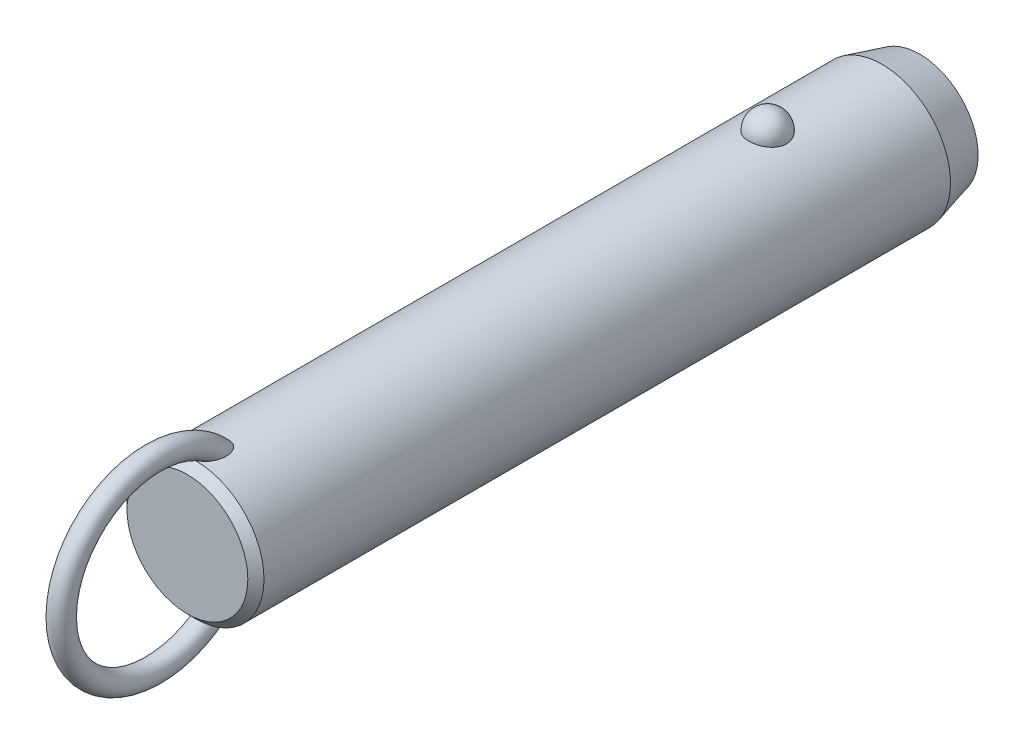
ISO-10303-21;
HEADER;
FILE_DESCRIPTION(('STEP AP214'),'2;1');
FILE_NAME('part.step','',(''),(''),'','','');
FILE_SCHEMA(('AUTOMOTIVE_DESIGN { 1 0 10303 214 1 1 1 1 }'));
ENDSEC;
DATA;
#1=APPLICATION_CONTEXT('core data for automotive mechanical design processes');
#2=APPLICATION_PROTOCOL_DEFINITION('international standard','automotive_design',2000,#1);
#3=PRODUCT_CONTEXT('',#1,'mechanical');
#4=PRODUCT('Part','Part','',(#3));
#5=PRODUCT_RELATED_PRODUCT_CATEGORY('part','',(#4));
#6=PRODUCT_DEFINITION_FORMATION('','',#4);
#7=PRODUCT_DEFINITION_CONTEXT('part definition',#1,'design');
#8=PRODUCT_DEFINITION('design','',#6,#7);
#9=PRODUCT_DEFINITION_SHAPE('','',#8);
#10=(LENGTH_UNIT() NAMED_UNIT(*) SI_UNIT(.MILLI.,.METRE.));
#11=(NAMED_UNIT(*) PLANE_ANGLE_UNIT() SI_UNIT($,.RADIAN.));
#12=(NAMED_UNIT(*) SI_UNIT($,.STERADIAN.) SOLID_ANGLE_UNIT());
#13=UNCERTAINTY_MEASURE_WITH_UNIT(LENGTH_MEASURE(1.E-05),#10,'distance_accuracy_value','');
#14=(GEOMETRIC_REPRESENTATION_CONTEXT(3) GLOBAL_UNCERTAINTY_ASSIGNED_CONTEXT((#13)) GLOBAL_UNIT_ASSIGNED_CONTEXT((#10,
#11,#12)) REPRESENTATION_CONTEXT('',''));
#15=CARTESIAN_POINT('',(0.,0.,0.));
#16=DIRECTION('',(0.,0.,1.));
#17=DIRECTION('',(1.,0.,0.));
#18=AXIS2_PLACEMENT_3D('',#15,#16,#17);
#19=CARTESIAN_POINT('',(0.,0.,91.4));
#20=DIRECTION('',(0.,0.,-1.));
#21=DIRECTION('',(-1.,0.,0.));
#22=AXIS2_PLACEMENT_3D('',#19,#20,#21);
#23=CYLINDRICAL_SURFACE('',#22,12.7);
#24=CARTESIAN_POINT('',(3.46661256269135,12.2177165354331,-3.5));
#25=CARTESIAN_POINT('',(3.4666090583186,12.2177194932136,-3.30432790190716));
#26=CARTESIAN_POINT('',(3.45063567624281,12.2222841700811,-3.10861112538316));
#27=CARTESIAN_POINT('',(3.38712451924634,12.2400345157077,-2.72271899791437));
#28=CARTESIAN_POINT('',(3.33957415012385,12.2532236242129,-2.53254588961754));
#29=CARTESIAN_POINT('',(3.2141234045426,12.286724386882,-2.16324948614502));
#30=CARTESIAN_POINT('',(3.13623639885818,12.3070329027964,-1.98412136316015));
#31=CARTESIAN_POINT('',(2.95205930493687,12.3525018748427,-1.64180592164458));
#32=CARTESIAN_POINT('',(2.84577003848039,12.3776621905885,-1.47861814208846));
#33=CARTESIAN_POINT('',(2.60688050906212,12.4301712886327,-1.17190583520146));
#34=CARTESIAN_POINT('',(2.47415697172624,12.4575299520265,-1.02847897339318));
#35=CARTESIAN_POINT('',(2.18615174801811,12.5112810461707,-0.766177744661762));
#36=CARTESIAN_POINT('',(2.03087002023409,12.5376734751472,-0.64730342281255));
#37=CARTESIAN_POINT('',(1.70237334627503,12.5864761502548,-0.437732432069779));
#38=CARTESIAN_POINT('',(1.52920948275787,12.6088972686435,-0.346958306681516));
#39=CARTESIAN_POINT('',(1.16944170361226,12.6473352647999,-0.195750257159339));
#40=CARTESIAN_POINT('',(0.982839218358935,12.663352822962,-0.135313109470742));
#41=CARTESIAN_POINT('',(0.604961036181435,12.6869706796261,-0.0473241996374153));
#42=CARTESIAN_POINT('',(0.413823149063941,12.6947125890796,-0.0192185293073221));
#43=CARTESIAN_POINT('',(0.0293827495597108,12.7014203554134,0.00517254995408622));
#44=CARTESIAN_POINT('',(-0.163919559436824,12.7003870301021,0.00146092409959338));
#45=CARTESIAN_POINT('',(-0.544374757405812,12.689735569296,-0.0373939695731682));
#46=CARTESIAN_POINT('',(-0.731575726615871,12.6802364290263,-0.0721015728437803));
#47=CARTESIAN_POINT('',(-1.09733277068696,12.6538333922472,-0.171364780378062));
#48=CARTESIAN_POINT('',(-1.27588869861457,12.6369293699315,-0.235920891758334));
#49=CARTESIAN_POINT('',(-1.6204698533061,12.5973946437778,-0.393548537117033));
#50=CARTESIAN_POINT('',(-1.78641865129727,12.5747321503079,-0.486778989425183));
#51=CARTESIAN_POINT('',(-2.10030671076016,12.5261316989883,-0.699110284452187));
#52=CARTESIAN_POINT('',(-2.24824419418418,12.5001934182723,-0.818213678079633));
#53=CARTESIAN_POINT('',(-2.52491489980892,12.4472906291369,-1.08157124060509));
#54=CARTESIAN_POINT('',(-2.65324222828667,12.4203160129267,-1.22624992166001));
#55=CARTESIAN_POINT('',(-2.88410007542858,12.3687509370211,-1.53528325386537));
#56=CARTESIAN_POINT('',(-2.98662883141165,12.3441606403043,-1.69963924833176));
#57=CARTESIAN_POINT('',(-3.16432417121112,12.2998199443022,-2.04548497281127));
#58=CARTESIAN_POINT('',(-3.23917525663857,12.2801261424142,-2.22714424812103));
#59=CARTESIAN_POINT('',(-3.35800573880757,12.248167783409,-2.6009138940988));
#60=CARTESIAN_POINT('',(-3.4019860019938,12.2359030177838,-2.79302397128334));
#61=CARTESIAN_POINT('',(-3.45784812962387,12.2202347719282,-3.18140279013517));
#62=CARTESIAN_POINT('',(-3.46986123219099,12.2167950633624,-3.37765118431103));
#63=CARTESIAN_POINT('',(-3.46186273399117,12.2190638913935,-3.76943689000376));
#64=CARTESIAN_POINT('',(-3.44185196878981,12.2247721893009,-3.96497421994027));
#65=CARTESIAN_POINT('',(-3.37048652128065,12.2446381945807,-4.34881728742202));
#66=CARTESIAN_POINT('',(-3.31928253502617,12.2587552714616,-4.53715319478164));
#67=CARTESIAN_POINT('',(-3.18693461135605,12.2938237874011,-4.90231727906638));
#68=CARTESIAN_POINT('',(-3.1057895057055,12.3147754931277,-5.07914500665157));
#69=CARTESIAN_POINT('',(-2.91506431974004,12.3613125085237,-5.41732059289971));
#70=CARTESIAN_POINT('',(-2.80533587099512,12.3869217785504,-5.57858147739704));
#71=CARTESIAN_POINT('',(-2.560414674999,12.4398525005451,-5.88013283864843));
#72=CARTESIAN_POINT('',(-2.42522099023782,12.4671740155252,-6.02042254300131));
#73=CARTESIAN_POINT('',(-2.1323357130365,12.5205965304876,-6.27662798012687));
#74=CARTESIAN_POINT('',(-1.97456596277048,12.5466928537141,-6.3924554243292));
#75=CARTESIAN_POINT('',(-1.64115839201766,12.5946384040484,-6.59583547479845));
#76=CARTESIAN_POINT('',(-1.46552179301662,12.6164879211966,-6.68339001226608));
#77=CARTESIAN_POINT('',(-1.10356050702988,12.6532533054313,-6.82682153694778));
#78=CARTESIAN_POINT('',(-0.917391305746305,12.6682500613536,-6.8830698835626));
#79=CARTESIAN_POINT('',(-0.537836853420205,12.6900288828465,-6.96386887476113));
#80=CARTESIAN_POINT('',(-0.344452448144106,12.6968119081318,-6.9884232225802));
#81=CARTESIAN_POINT('',(0.0402577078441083,12.7013667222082,-7.00496469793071));
#82=CARTESIAN_POINT('',(0.231556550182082,12.6993008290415,-6.99753844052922));
#83=CARTESIAN_POINT('',(0.610105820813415,12.6867505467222,-6.9516636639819));
#84=CARTESIAN_POINT('',(0.797356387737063,12.6762664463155,-6.913216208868));
#85=CARTESIAN_POINT('',(1.16186657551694,12.6480587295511,-6.80658431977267));
#86=CARTESIAN_POINT('',(1.33915951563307,12.6303611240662,-6.73850666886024));
#87=CARTESIAN_POINT('',(1.67968518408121,12.5896027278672,-6.5745087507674));
#88=CARTESIAN_POINT('',(1.84291705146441,12.5665416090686,-6.47858678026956));
#89=CARTESIAN_POINT('',(2.15340192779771,12.5171072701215,-6.25982455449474));
#90=CARTESIAN_POINT('',(2.30037831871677,12.4906895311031,-6.13660186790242));
#91=CARTESIAN_POINT('',(2.5717412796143,12.4376567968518,-5.86739587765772));
#92=CARTESIAN_POINT('',(2.69612388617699,12.4110417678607,-5.72140858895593));
#93=CARTESIAN_POINT('',(2.92107785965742,12.360051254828,-5.40794137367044));
#94=CARTESIAN_POINT('',(3.02121329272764,12.3357209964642,-5.24014110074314));
#95=CARTESIAN_POINT('',(3.19236291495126,12.2925446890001,-4.88969865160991));
#96=CARTESIAN_POINT('',(3.26338839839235,12.2736965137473,-4.70706226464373));
#97=CARTESIAN_POINT('',(3.36788038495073,12.245404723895,-4.35469510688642));
#98=CARTESIAN_POINT('',(3.40484026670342,12.2351018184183,-4.18605935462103));
#99=CARTESIAN_POINT('',(3.45420764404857,12.2212564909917,-3.84496058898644));
#100=CARTESIAN_POINT('',(3.46661565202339,12.2177139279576,-3.67249765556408));
#101=CARTESIAN_POINT('',(3.46661256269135,12.2177165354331,-3.5));
#102=B_SPLINE_CURVE_WITH_KNOTS('',3,(#24,#25,#26,#27,#28,#29,#30,#31,#32,#33,#34,#35,#36,#37,
#38,#39,#40,#41,#42,#43,#44,#45,#46,#47,#48,#49,#50,#51,#52,#53,#54,#55,#56,#57,#58,#59,#60,#61,
#62,#63,#64,#65,#66,#67,#68,#69,#70,#71,#72,#73,#74,#75,#76,#77,#78,#79,#80,#81,#82,#83,#84,#85,
#86,#87,#88,#89,#90,#91,#92,#93,#94,#95,#96,#97,#98,#99,#100,#101),.UNSPECIFIED.,.T.,.F.,(4,2,2,
2,2,2,2,2,2,2,2,2,2,2,2,2,2,2,2,2,2,2,2,2,2,2,2,2,2,2,2,2,2,2,2,2,2,2,4),(0.,0.586396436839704,
1.17302689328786,1.7593990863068,2.34575431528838,2.93491084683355,3.52406845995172,
4.11158733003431,4.69904375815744,5.2762784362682,5.85345931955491,6.42265312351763,
6.99185659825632,7.56427334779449,8.136746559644,8.71981013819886,9.3029135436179,
9.89247258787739,10.4820150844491,11.0691335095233,11.6562366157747,12.2405256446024,
12.8248374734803,13.412244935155,13.9996740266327,14.5891883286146,15.1786623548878,
15.7609861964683,16.3432419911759,16.914863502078,17.4864654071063,18.056024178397,
18.6256177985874,19.2037609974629,19.7820055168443,20.3699810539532,20.9577282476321,
21.4746855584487,21.9916320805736),.UNSPECIFIED.);
#103=CARTESIAN_POINT('',(3.46661256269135,12.2177165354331,-3.5));
#104=VERTEX_POINT('',#103);
#105=EDGE_CURVE('E41',#104,#104,#102,.T.);
#106=ORIENTED_EDGE('',*,*,#105,.T.);
#107=EDGE_LOOP('',(#106));
#108=FACE_BOUND('',#107,.T.);
#109=CARTESIAN_POINT('',(0.,0.,102.6));
#110=DIRECTION('',(0.,0.,1.));
#111=DIRECTION('',(1.,0.,0.));
#112=AXIS2_PLACEMENT_3D('',#109,#110,#111);
#113=CIRCLE('',#112,12.7);
#114=CARTESIAN_POINT('',(12.7,0.,102.6));
#115=VERTEX_POINT('',#114);
#116=EDGE_CURVE('E10',#115,#115,#113,.F.);
#117=ORIENTED_EDGE('',*,*,#116,.T.);
#118=EDGE_LOOP('',(#117));
#119=FACE_BOUND('',#118,.T.);
#120=CARTESIAN_POINT('',(-0.548122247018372,-12.6881662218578,96.3432187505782));
#121=CARTESIAN_POINT('',(-0.648865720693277,-12.6838128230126,96.377926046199));
#122=CARTESIAN_POINT('',(-0.746398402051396,-12.6783867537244,96.4220428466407));
#123=CARTESIAN_POINT('',(-0.932125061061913,-12.666091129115,96.5267647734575));
#124=CARTESIAN_POINT('',(-1.02030388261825,-12.6592192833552,96.587396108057));
#125=CARTESIAN_POINT('',(-1.18487740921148,-12.6448747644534,96.721847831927));
#126=CARTESIAN_POINT('',(-1.26134296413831,-12.637406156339,96.7955825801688));
#127=CARTESIAN_POINT('',(-1.4023120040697,-12.6225412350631,96.9536045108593));
#128=CARTESIAN_POINT('',(-1.46681470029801,-12.6151449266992,97.0378923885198));
#129=CARTESIAN_POINT('',(-1.60714786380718,-12.5981718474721,97.2496577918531));
#130=CARTESIAN_POINT('',(-1.67725126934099,-12.588900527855,97.380962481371));
#131=CARTESIAN_POINT('',(-1.79536591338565,-12.5725964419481,97.6532471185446));
#132=CARTESIAN_POINT('',(-1.84333535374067,-12.5655679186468,97.7942447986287));
#133=CARTESIAN_POINT('',(-1.93422576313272,-12.5519624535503,98.1376455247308));
#134=CARTESIAN_POINT('',(-1.96788773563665,-12.5466298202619,98.3425578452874));
#135=CARTESIAN_POINT('',(-1.9941399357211,-12.542463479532,98.6517600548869));
#136=CARTESIAN_POINT('',(-1.99883864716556,-12.5417153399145,98.7552987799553));
#137=CARTESIAN_POINT('',(-2.00078003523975,-12.5414074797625,98.9624512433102));
#138=CARTESIAN_POINT('',(-1.99802449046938,-12.5418474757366,99.0660649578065));
#139=CARTESIAN_POINT('',(-1.98336733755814,-12.5441750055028,99.3103207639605));
#140=CARTESIAN_POINT('',(-1.96851430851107,-12.5465291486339,99.4507804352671));
#141=CARTESIAN_POINT('',(-1.92707089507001,-12.5529612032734,99.7299607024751));
#142=CARTESIAN_POINT('',(-1.90047458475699,-12.5570399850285,99.8686803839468));
#143=CARTESIAN_POINT('',(-1.83619120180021,-12.5666008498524,100.14341135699));
#144=CARTESIAN_POINT('',(-1.79850828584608,-12.57208240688,100.279423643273));
#145=CARTESIAN_POINT('',(-1.71223796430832,-12.5841228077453,100.547842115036));
#146=CARTESIAN_POINT('',(-1.66365679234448,-12.5906810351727,100.680250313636));
#147=CARTESIAN_POINT('',(-1.5780450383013,-12.6016176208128,100.88548877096));
#148=CARTESIAN_POINT('',(-1.54477252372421,-12.6057501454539,100.959914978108));
#149=CARTESIAN_POINT('',(-1.47424480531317,-12.6141930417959,101.106839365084));
#150=CARTESIAN_POINT('',(-1.43699041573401,-12.6185033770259,101.179337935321));
#151=CARTESIAN_POINT('',(-1.35825795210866,-12.6272207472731,101.321892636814));
#152=CARTESIAN_POINT('',(-1.31678520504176,-12.6316276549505,101.391951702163));
#153=CARTESIAN_POINT('',(-1.22917793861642,-12.6404532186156,101.529070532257));
#154=CARTESIAN_POINT('',(-1.18304514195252,-12.6448718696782,101.596131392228));
#155=CARTESIAN_POINT('',(-1.07246411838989,-12.6547893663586,101.743874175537));
#156=CARTESIAN_POINT('',(-1.00642239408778,-12.6602600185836,101.823384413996));
#157=CARTESIAN_POINT('',(-0.864441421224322,-12.6707460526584,101.973169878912));
#158=CARTESIAN_POINT('',(-0.788516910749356,-12.6757620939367,102.043458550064));
#159=CARTESIAN_POINT('',(-0.652215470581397,-12.6833591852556,102.148680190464));
#160=CARTESIAN_POINT('',(-0.594982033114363,-12.6861973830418,102.187624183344));
#161=CARTESIAN_POINT('',(-0.475269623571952,-12.6912445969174,102.256489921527));
#162=CARTESIAN_POINT('',(-0.412800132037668,-12.6934547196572,102.286427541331));
#163=CARTESIAN_POINT('',(-0.295749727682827,-12.6966636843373,102.329756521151));
#164=CARTESIAN_POINT('',(-0.241949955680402,-12.6978134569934,102.345218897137));
#165=CARTESIAN_POINT('',(-0.132508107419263,-12.6994261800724,102.366884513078));
#166=CARTESIAN_POINT('',(-0.076867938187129,-12.6998898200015,102.373097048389));
#167=CARTESIAN_POINT('',(0.0347696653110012,-12.7000752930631,102.375583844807));
#168=CARTESIAN_POINT('',(0.0907676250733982,-12.6997954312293,102.371835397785));
#169=CARTESIAN_POINT('',(0.201283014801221,-12.6985255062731,102.354788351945));
#170=CARTESIAN_POINT('',(0.255799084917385,-12.6975348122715,102.341481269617));
#171=CARTESIAN_POINT('',(0.376042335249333,-12.6946091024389,102.30203792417));
#172=CARTESIAN_POINT('',(0.44095085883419,-12.6924943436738,102.273449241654));
#173=CARTESIAN_POINT('',(0.565350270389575,-12.6875639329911,102.206323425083));
#174=CARTESIAN_POINT('',(0.624828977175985,-12.6847467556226,102.167764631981));
#175=CARTESIAN_POINT('',(0.774116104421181,-12.6767252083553,102.056949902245));
#176=CARTESIAN_POINT('',(0.859449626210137,-12.6711344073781,101.978760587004));
#177=CARTESIAN_POINT('',(1.01789440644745,-12.6593922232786,101.810943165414));
#178=CARTESIAN_POINT('',(1.09096902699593,-12.653239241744,101.721282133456));
#179=CARTESIAN_POINT('',(1.22268793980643,-12.6411674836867,101.540265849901));
#180=CARTESIAN_POINT('',(1.28193986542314,-12.6352572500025,101.449345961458));
#181=CARTESIAN_POINT('',(1.39259777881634,-12.6235401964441,101.262792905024));
#182=CARTESIAN_POINT('',(1.44399707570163,-12.6177334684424,101.167155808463));
#183=CARTESIAN_POINT('',(1.53972870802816,-12.6064093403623,100.972273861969));
#184=CARTESIAN_POINT('',(1.58405262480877,-12.6008922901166,100.873024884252));
#185=CARTESIAN_POINT('',(1.66600705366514,-12.5903187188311,100.671772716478));
#186=CARTESIAN_POINT('',(1.70363651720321,-12.5852622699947,100.569769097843));
#187=CARTESIAN_POINT('',(1.77545379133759,-12.5753406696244,100.354358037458));
#188=CARTESIAN_POINT('',(1.80903453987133,-12.5705328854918,100.240745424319));
#189=CARTESIAN_POINT('',(1.86844163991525,-12.5618400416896,100.011457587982));
#190=CARTESIAN_POINT('',(1.89426665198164,-12.5579551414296,99.8957820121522));
#191=CARTESIAN_POINT('',(1.9378546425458,-12.5513030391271,99.6630072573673));
#192=CARTESIAN_POINT('',(1.95562640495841,-12.5485346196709,99.5459097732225));
#193=CARTESIAN_POINT('',(1.98264463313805,-12.5442934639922,99.3107473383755));
#194=CARTESIAN_POINT('',(1.99189298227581,-12.5428204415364,99.1926826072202));
#195=CARTESIAN_POINT('',(2.00416068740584,-12.540871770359,98.8806225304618));
#196=CARTESIAN_POINT('',(1.99944433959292,-12.541631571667,98.6862290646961));
#197=CARTESIAN_POINT('',(1.96113755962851,-12.5476846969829,98.3003095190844));
#198=CARTESIAN_POINT('',(1.92758341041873,-12.5529723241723,98.1087801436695));
#199=CARTESIAN_POINT('',(1.8393434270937,-12.5661532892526,97.7822728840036));
#200=CARTESIAN_POINT('',(1.79215440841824,-12.5730485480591,97.6452499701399));
#201=CARTESIAN_POINT('',(1.67676242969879,-12.588958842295,97.380445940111));
#202=CARTESIAN_POINT('',(1.60859050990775,-12.597970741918,97.2526515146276));
#203=CARTESIAN_POINT('',(1.46583832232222,-12.6152829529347,97.0358006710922));
#204=CARTESIAN_POINT('',(1.39525727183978,-12.6233659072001,96.9441050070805));
#205=CARTESIAN_POINT('',(1.23992594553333,-12.6395676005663,96.7734854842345));
#206=CARTESIAN_POINT('',(1.15517932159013,-12.6476863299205,96.6945583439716));
#207=CARTESIAN_POINT('',(0.971995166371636,-12.6630846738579,96.5526438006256));
#208=CARTESIAN_POINT('',(0.873456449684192,-12.6703572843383,96.4897849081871));
#209=CARTESIAN_POINT('',(0.665847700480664,-12.6829569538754,96.3844870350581));
#210=CARTESIAN_POINT('',(0.556784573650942,-12.688285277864,96.3420347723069));
#211=CARTESIAN_POINT('',(0.347338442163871,-12.6956226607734,96.2844434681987));
#212=CARTESIAN_POINT('',(0.247759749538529,-12.6979816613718,96.2663996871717));
#213=CARTESIAN_POINT('',(0.047021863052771,-12.7003077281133,96.2486007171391));
#214=CARTESIAN_POINT('',(-0.054135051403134,-12.7002779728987,96.2488212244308));
#215=CARTESIAN_POINT('',(-0.221414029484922,-12.6982482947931,96.2643639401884));
#216=CARTESIAN_POINT('',(-0.288055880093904,-12.6969033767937,96.2746662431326));
#217=CARTESIAN_POINT('',(-0.419599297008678,-12.6932369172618,96.3031348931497));
#218=CARTESIAN_POINT('',(-0.484501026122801,-12.6909154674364,96.3213005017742));
#219=CARTESIAN_POINT('',(-0.548122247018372,-12.6881662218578,96.3432187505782));
#220=B_SPLINE_CURVE_WITH_KNOTS('',3,(#120,#121,#122,#123,#124,#125,#126,#127,#128,#129,#130,
#131,#132,#133,#134,#135,#136,#137,#138,#139,#140,#141,#142,#143,#144,#145,#146,#147,#148,#149,
#150,#151,#152,#153,#154,#155,#156,#157,#158,#159,#160,#161,#162,#163,#164,#165,#166,#167,#168,
#169,#170,#171,#172,#173,#174,#175,#176,#177,#178,#179,#180,#181,#182,#183,#184,#185,#186,#187,
#188,#189,#190,#191,#192,#193,#194,#195,#196,#197,#198,#199,#200,#201,#202,#203,#204,#205,#206,
#207,#208,#209,#210,#211,#212,#213,#214,#215,#216,#217,#218,#219),.UNSPECIFIED.,.T.,.F.,(4,2,2,
2,2,2,2,2,2,2,2,2,2,2,2,2,2,2,2,2,2,2,2,2,2,2,2,2,2,2,2,2,2,2,2,2,2,2,2,2,2,2,2,2,2,2,2,2,2,4),
(0.,0.319642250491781,0.639794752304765,0.957927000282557,1.27608021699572,1.72100165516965,
2.16675988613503,2.78630021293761,3.09705782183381,3.40774128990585,3.83096358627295,
4.2543996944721,4.67767724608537,5.10071330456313,5.34550297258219,5.59024267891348,
5.8346770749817,6.07902143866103,6.38891080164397,6.69834321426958,6.90560910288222,
7.11250749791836,7.27977315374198,7.44687060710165,7.61434932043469,7.78197685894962,
7.99365544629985,8.20579780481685,8.55147335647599,8.89816429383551,9.22375138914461,
9.5496143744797,9.87586224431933,10.202161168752,10.557587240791,10.9130746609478,
11.2681734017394,11.6231936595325,12.2046601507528,12.7853961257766,13.219164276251,
13.6522938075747,13.9989174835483,14.3454519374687,14.6946768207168,15.0436740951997,
15.3457513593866,15.6474266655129,15.8493051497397,16.0511646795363),.UNSPECIFIED.);
#221=CARTESIAN_POINT('',(-0.548122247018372,-12.6881662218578,96.3432187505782));
#222=VERTEX_POINT('',#221);
#223=EDGE_CURVE('E60',#222,#222,#220,.T.);
#224=ORIENTED_EDGE('',*,*,#223,.T.);
#225=EDGE_LOOP('',(#224));
#226=FACE_BOUND('',#225,.T.);
#227=CARTESIAN_POINT('',(-0.548122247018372,12.6881662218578,96.3432187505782));
#228=CARTESIAN_POINT('',(-0.459436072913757,12.6919968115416,96.312673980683));
#229=CARTESIAN_POINT('',(-0.368189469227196,12.6949996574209,96.2893913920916));
#230=CARTESIAN_POINT('',(-0.183024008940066,12.6990186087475,96.2584062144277));
#231=CARTESIAN_POINT('',(-0.0891049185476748,12.7000345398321,96.2507049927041));
#232=CARTESIAN_POINT('',(0.0987147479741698,12.6999636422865,96.2512455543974));
#233=CARTESIAN_POINT('',(0.192615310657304,12.6988761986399,96.2594920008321));
#234=CARTESIAN_POINT('',(0.37765885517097,12.6947211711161,96.2915515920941));
#235=CARTESIAN_POINT('',(0.468801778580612,12.6916535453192,96.3153650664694));
#236=CARTESIAN_POINT('',(0.645809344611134,12.6838788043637,96.3774565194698));
#237=CARTESIAN_POINT('',(0.731679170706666,12.6791733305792,96.415720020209));
#238=CARTESIAN_POINT('',(0.896315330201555,12.6686004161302,96.5051204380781));
#239=CARTESIAN_POINT('',(0.975080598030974,12.6627328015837,96.5562592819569));
#240=CARTESIAN_POINT('',(1.12963655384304,12.6499161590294,96.6736782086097));
#241=CARTESIAN_POINT('',(1.20478673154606,12.6429194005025,96.7407929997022));
#242=CARTESIAN_POINT('',(1.34448241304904,12.6288282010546,96.8852250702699));
#243=CARTESIAN_POINT('',(1.40902173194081,12.621733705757,96.9625482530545));
#244=CARTESIAN_POINT('',(1.55208211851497,12.6050877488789,97.1592475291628));
#245=CARTESIAN_POINT('',(1.62510490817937,12.5957546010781,97.2826540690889));
#246=CARTESIAN_POINT('',(1.7501904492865,12.5789823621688,97.5397690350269));
#247=CARTESIAN_POINT('',(1.80221377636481,12.5715468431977,97.673496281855));
#248=CARTESIAN_POINT('',(1.90309965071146,12.5567434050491,97.9983516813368));
#249=CARTESIAN_POINT('',(1.94342317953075,12.5504515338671,98.1921611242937));
#250=CARTESIAN_POINT('',(1.99332997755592,12.5426147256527,98.5837881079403));
#251=CARTESIAN_POINT('',(2.00285305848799,12.5410790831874,98.7816127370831));
#252=CARTESIAN_POINT('',(1.99678999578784,12.5420407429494,99.1166427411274));
#253=CARTESIAN_POINT('',(1.98794117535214,12.5434564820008,99.2540428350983));
#254=CARTESIAN_POINT('',(1.95865119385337,12.5480641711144,99.5276394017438));
#255=CARTESIAN_POINT('',(1.9382043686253,12.5512569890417,99.6638352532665));
#256=CARTESIAN_POINT('',(1.88647896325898,12.5591352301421,99.9342493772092));
#257=CARTESIAN_POINT('',(1.85518800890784,12.5638223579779,100.06846520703));
#258=CARTESIAN_POINT('',(1.78217886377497,12.5743868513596,100.333936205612));
#259=CARTESIAN_POINT('',(1.74046509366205,12.5802637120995,100.465192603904));
#260=CARTESIAN_POINT('',(1.66024095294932,12.5910571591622,100.686085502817));
#261=CARTESIAN_POINT('',(1.62434772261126,12.5957535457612,100.776690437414));
#262=CARTESIAN_POINT('',(1.54709009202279,12.6054762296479,100.955512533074));
#263=CARTESIAN_POINT('',(1.50572681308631,12.6105024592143,101.043730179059));
#264=CARTESIAN_POINT('',(1.41728020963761,12.620748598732,101.216932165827));
#265=CARTESIAN_POINT('',(1.37021377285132,12.625967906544,101.301925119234));
#266=CARTESIAN_POINT('',(1.2696962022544,12.6364721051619,101.468007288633));
#267=CARTESIAN_POINT('',(1.21624929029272,12.6417569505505,101.549099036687));
#268=CARTESIAN_POINT('',(1.10304413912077,12.6521331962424,101.704702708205));
#269=CARTESIAN_POINT('',(1.04340936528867,12.657226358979,101.779303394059));
#270=CARTESIAN_POINT('',(0.91591933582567,12.6670906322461,101.921324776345));
#271=CARTESIAN_POINT('',(0.84806456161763,12.6718617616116,101.988745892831));
#272=CARTESIAN_POINT('',(0.717035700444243,12.67987711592,102.100624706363));
#273=CARTESIAN_POINT('',(0.655526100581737,12.6832377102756,102.146997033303));
#274=CARTESIAN_POINT('',(0.525985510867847,12.6892676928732,102.229619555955));
#275=CARTESIAN_POINT('',(0.457969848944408,12.6919386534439,102.265892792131));
#276=CARTESIAN_POINT('',(0.334859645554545,12.695691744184,102.316657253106));
#277=CARTESIAN_POINT('',(0.281116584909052,12.6970073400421,102.334373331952));
#278=CARTESIAN_POINT('',(0.17142581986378,12.6989609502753,102.360642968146));
#279=CARTESIAN_POINT('',(0.11548082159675,12.699599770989,102.369207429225));
#280=CARTESIAN_POINT('',(0.00272618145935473,12.7001251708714,102.376253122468));
#281=CARTESIAN_POINT('',(-0.0540859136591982,12.7000089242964,102.374696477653));
#282=CARTESIAN_POINT('',(-0.166544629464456,12.6990328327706,102.361600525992));
#283=CARTESIAN_POINT('',(-0.222190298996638,12.6981724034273,102.350053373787));
#284=CARTESIAN_POINT('',(-0.342018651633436,12.695562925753,102.314912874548));
#285=CARTESIAN_POINT('',(-0.405606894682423,12.6936676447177,102.28933225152));
#286=CARTESIAN_POINT('',(-0.527815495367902,12.6891754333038,102.228311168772));
#287=CARTESIAN_POINT('',(-0.586425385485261,12.6865770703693,102.192850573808));
#288=CARTESIAN_POINT('',(-0.731842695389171,12.6792129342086,102.091496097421));
#289=CARTESIAN_POINT('',(-0.814709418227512,12.6740767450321,102.0200395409));
#290=CARTESIAN_POINT('',(-0.969101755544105,12.6632083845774,101.86589007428));
#291=CARTESIAN_POINT('',(-1.04059564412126,12.6574746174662,101.783166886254));
#292=CARTESIAN_POINT('',(-1.1698111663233,12.6461638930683,101.615809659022));
#293=CARTESIAN_POINT('',(-1.22811369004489,12.6405994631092,101.531616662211));
#294=CARTESIAN_POINT('',(-1.33743405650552,12.6295007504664,101.358579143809));
#295=CARTESIAN_POINT('',(-1.38844577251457,12.6239664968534,101.269730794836));
#296=CARTESIAN_POINT('',(-1.48400702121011,12.6130898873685,101.088389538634));
#297=CARTESIAN_POINT('',(-1.52854232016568,12.6077479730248,100.995889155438));
#298=CARTESIAN_POINT('',(-1.6115011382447,12.5974127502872,100.808160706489));
#299=CARTESIAN_POINT('',(-1.64992317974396,12.5924195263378,100.712931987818));
#300=CARTESIAN_POINT('',(-1.73468589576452,12.581070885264,100.48289362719));
#301=CARTESIAN_POINT('',(-1.77831261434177,12.5749388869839,100.347066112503));
#302=CARTESIAN_POINT('',(-1.85439734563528,12.5639437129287,100.072212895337));
#303=CARTESIAN_POINT('',(-1.88684994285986,12.5590811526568,99.9331856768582));
#304=CARTESIAN_POINT('',(-1.94008483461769,12.550968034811,99.6530923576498));
#305=CARTESIAN_POINT('',(-1.96088706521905,12.5477147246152,99.5120301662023));
#306=CARTESIAN_POINT('',(-1.99000539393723,12.5431291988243,99.2286689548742));
#307=CARTESIAN_POINT('',(-1.99832911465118,12.5417958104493,99.0863707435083));
#308=CARTESIAN_POINT('',(-2.00166624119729,12.5412674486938,98.7576271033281));
#309=CARTESIAN_POINT('',(-1.99178843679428,12.5428579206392,98.571088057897));
#310=CARTESIAN_POINT('',(-1.9445518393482,12.5502731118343,98.2016240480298));
#311=CARTESIAN_POINT('',(-1.90724032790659,12.5560905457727,98.0186934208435));
#312=CARTESIAN_POINT('',(-1.81330718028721,12.5699462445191,97.7048488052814));
#313=CARTESIAN_POINT('',(-1.76338820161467,12.5771273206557,97.5719105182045));
#314=CARTESIAN_POINT('',(-1.64305018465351,12.593414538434,97.3156813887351));
#315=CARTESIAN_POINT('',(-1.57265346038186,12.6025185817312,97.192380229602));
#316=CARTESIAN_POINT('',(-1.42634956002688,12.6198178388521,96.9835648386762));
#317=CARTESIAN_POINT('',(-1.35423772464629,12.6278405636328,96.8953846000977));
#318=CARTESIAN_POINT('',(-1.19645664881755,12.6437632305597,96.732107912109));
#319=CARTESIAN_POINT('',(-1.11080536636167,12.6516633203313,96.6569944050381));
#320=CARTESIAN_POINT('',(-0.947219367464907,12.6648319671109,96.5378114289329));
#321=CARTESIAN_POINT('',(-0.871624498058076,12.670300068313,96.4905414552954));
#322=CARTESIAN_POINT('',(-0.714161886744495,12.6801492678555,96.4077413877));
#323=CARTESIAN_POINT('',(-0.632295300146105,12.684530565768,96.3722091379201));
#324=CARTESIAN_POINT('',(-0.548122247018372,12.6881662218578,96.3432187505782));
#325=B_SPLINE_CURVE_WITH_KNOTS('',3,(#227,#228,#229,#230,#231,#232,#233,#234,#235,#236,#237,
#238,#239,#240,#241,#242,#243,#244,#245,#246,#247,#248,#249,#250,#251,#252,#253,#254,#255,#256,
#257,#258,#259,#260,#261,#262,#263,#264,#265,#266,#267,#268,#269,#270,#271,#272,#273,#274,#275,
#276,#277,#278,#279,#280,#281,#282,#283,#284,#285,#286,#287,#288,#289,#290,#291,#292,#293,#294,
#295,#296,#297,#298,#299,#300,#301,#302,#303,#304,#305,#306,#307,#308,#309,#310,#311,#312,#313,
#314,#315,#316,#317,#318,#319,#320,#321,#322,#323,#324),.UNSPECIFIED.,.T.,.F.,(4,2,2,2,2,2,2,2,
2,2,2,2,2,2,2,2,2,2,2,2,2,2,2,2,2,2,2,2,2,2,2,2,2,2,2,2,2,2,2,2,2,2,2,2,2,2,2,2,4),(0.,
0.281328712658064,0.562682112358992,0.844117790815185,1.12555942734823,1.40671982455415,
1.68792232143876,1.98972294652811,2.29169886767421,2.72039860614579,3.14989948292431,
3.74084916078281,4.33295293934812,4.74554109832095,5.15833092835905,5.57159335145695,
5.98468079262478,6.27722775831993,6.56971484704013,6.86135609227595,7.15280542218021,
7.43927407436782,7.72572595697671,7.9563586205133,8.18646071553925,8.35559393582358,
8.52452541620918,8.69408946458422,8.86378678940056,9.06834348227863,9.27332014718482,
9.60010414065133,9.92778432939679,10.2350252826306,10.5425229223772,10.8506864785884,
11.1589244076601,11.5867893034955,12.0148612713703,12.4421984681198,12.8692745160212,
13.4279365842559,13.9856380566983,14.4107062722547,14.8353130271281,15.1765567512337,
15.5173516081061,15.7844129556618,16.051425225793),.UNSPECIFIED.);
#326=CARTESIAN_POINT('',(-0.548122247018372,12.6881662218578,96.3432187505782));
#327=VERTEX_POINT('',#326);
#328=EDGE_CURVE('E68',#327,#327,#325,.T.);
#329=ORIENTED_EDGE('',*,*,#328,.T.);
#330=EDGE_LOOP('',(#329));
#331=FACE_BOUND('',#330,.T.);
#332=CARTESIAN_POINT('',(0.,0.,-24.7000000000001));
#333=DIRECTION('',(0.,0.,-1.));
#334=DIRECTION('',(-1.,0.,0.));
#335=AXIS2_PLACEMENT_3D('',#332,#333,#334);
#336=CIRCLE('',#335,12.7);
#337=CARTESIAN_POINT('',(-12.7,0.,-24.7000000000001));
#338=VERTEX_POINT('',#337);
#339=EDGE_CURVE('E57',#338,#338,#336,.F.);
#340=ORIENTED_EDGE('',*,*,#339,.T.);
#341=EDGE_LOOP('',(#340));
#342=FACE_BOUND('',#341,.T.);
#343=ADVANCED_FACE('F37',(#108,#119,#226,#331,#342),#23,.T.);
#344=CARTESIAN_POINT('',(0.,0.,-31.7));
#345=DIRECTION('',(0.,0.,-1.));
#346=DIRECTION('',(-1.,0.,0.));
#347=AXIS2_PLACEMENT_3D('',#344,#345,#346);
#348=PLANE('',#347);
#349=CARTESIAN_POINT('',(0.,0.,-31.7));
#350=DIRECTION('',(0.,0.,-1.));
#351=DIRECTION('',(-1.,0.,0.));
#352=AXIS2_PLACEMENT_3D('',#349,#350,#351);
#353=CIRCLE('',#352,10.8243556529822);
#354=CARTESIAN_POINT('',(-10.8243556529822,0.,-31.7));
#355=VERTEX_POINT('',#354);
#356=EDGE_CURVE('E67',#355,#355,#353,.T.);
#357=ORIENTED_EDGE('',*,*,#356,.T.);
#358=EDGE_LOOP('',(#357));
#359=FACE_BOUND('',#358,.T.);
#360=ADVANCED_FACE('F86',(#359),#348,.T.);
#361=CARTESIAN_POINT('',(0.,0.,-31.7));
#362=DIRECTION('',(0.,0.,1.));
#363=DIRECTION('',(1.,0.,0.));
#364=AXIS2_PLACEMENT_3D('',#361,#362,#363);
#365=CONICAL_SURFACE('',#364,10.8243556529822,0.261799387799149);
#366=ORIENTED_EDGE('',*,*,#339,.F.);
#367=EDGE_LOOP('',(#366));
#368=FACE_BOUND('',#367,.T.);
#369=ORIENTED_EDGE('',*,*,#356,.F.);
#370=EDGE_LOOP('',(#369));
#371=FACE_BOUND('',#370,.T.);
#372=ADVANCED_FACE('F84',(#368,#371),#365,.T.);
#373=CARTESIAN_POINT('',(0.,0.,104.1));
#374=DIRECTION('',(0.,0.,1.));
#375=DIRECTION('',(1.,0.,0.));
#376=AXIS2_PLACEMENT_3D('',#373,#374,#375);
#377=PLANE('',#376);
#378=CARTESIAN_POINT('',(0.,0.,104.1));
#379=DIRECTION('',(0.,0.,1.));
#380=DIRECTION('',(1.,0.,0.));
#381=AXIS2_PLACEMENT_3D('',#378,#379,#380);
#382=CIRCLE('',#381,11.2000000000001);
#383=CARTESIAN_POINT('',(11.2000000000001,0.,104.1));
#384=VERTEX_POINT('',#383);
#385=EDGE_CURVE('E50',#384,#384,#382,.T.);
#386=ORIENTED_EDGE('',*,*,#385,.T.);
#387=EDGE_LOOP('',(#386));
#388=FACE_BOUND('',#387,.T.);
#389=ADVANCED_FACE('F78',(#388),#377,.T.);
#390=CARTESIAN_POINT('',(0.,0.,110.45));
#391=DIRECTION('',(1.,0.,0.));
#392=DIRECTION('',(0.,0.,-1.));
#393=AXIS2_PLACEMENT_3D('',#390,#391,#392);
#394=TOROIDAL_SURFACE('',#393,17.05,2.);
#395=ORIENTED_EDGE('',*,*,#328,.F.);
#396=EDGE_LOOP('',(#395));
#397=FACE_BOUND('',#396,.T.);
#398=ORIENTED_EDGE('',*,*,#223,.F.);
#399=EDGE_LOOP('',(#398));
#400=FACE_BOUND('',#399,.T.);
#401=ADVANCED_FACE('F74',(#397,#400),#394,.T.);
#402=CARTESIAN_POINT('',(0.,0.,104.1));
#403=DIRECTION('',(0.,0.,-1.));
#404=DIRECTION('',(-1.,0.,0.));
#405=AXIS2_PLACEMENT_3D('',#402,#403,#404);
#406=CONICAL_SURFACE('',#405,11.2000000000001,0.785398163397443);
#407=ORIENTED_EDGE('',*,*,#116,.F.);
#408=EDGE_LOOP('',(#407));
#409=FACE_BOUND('',#408,.T.);
#410=ORIENTED_EDGE('',*,*,#385,.F.);
#411=EDGE_LOOP('',(#410));
#412=FACE_BOUND('',#411,.T.);
#413=ADVANCED_FACE('F39',(#409,#412),#406,.T.);
#414=CARTESIAN_POINT('',(0.,12.7,-3.5));
#415=DIRECTION('',(0.,1.,0.));
#416=DIRECTION('',(0.,0.,-1.));
#417=AXIS2_PLACEMENT_3D('',#414,#415,#416);
#418=SPHERICAL_SURFACE('',#417,3.5);
#419=ORIENTED_EDGE('',*,*,#105,.F.);
#420=EDGE_LOOP('',(#419));
#421=FACE_BOUND('',#420,.T.);
#422=ADVANCED_FACE('F80',(#421),#418,.T.);
#423=CLOSED_SHELL('',(#343,#360,#372,#389,#401,#413,#422));
#424=MANIFOLD_SOLID_BREP('B2',#423);
#425=ADVANCED_BREP_SHAPE_REPRESENTATION('',(#18,#424),#14);
#426=SHAPE_DEFINITION_REPRESENTATION(#9,#425);
ENDSEC;
END-ISO-10303-21;
